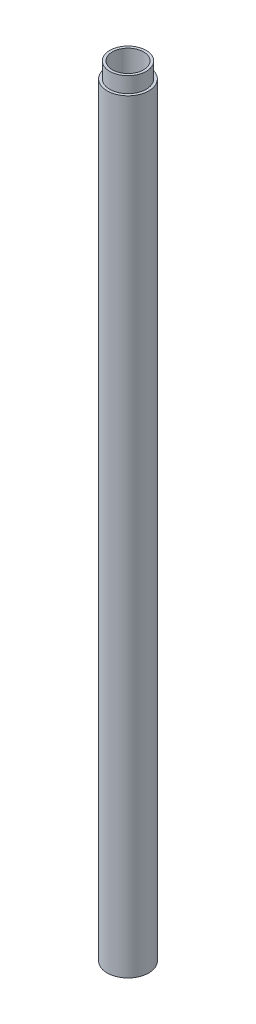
from build123d import *

# Parameters (mm, degrees)
SKICA1_R                 = 4
P_IDAT_VYSUNUT_M1_DEPTH  = 150
SKICA2_R                 = 3
ODEBRAT_VYSUNUT_M1_DEPTH = 151.106628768
SKICA3_OUTSIDE_W         = 40.086
SKICA3_OUTSIDE_H         = 40.086
SKICA3_OUTSIDE_R         = 3.5
ODEBRAT_VYSUNUT_M2_DEPTH = 3


with BuildPart() as part:
    # Skica1 → P_idat vysunut_m1 (new body)
    with BuildSketch(Plane(origin=(0, 0, 0), x_dir=(1, 0, 0), z_dir=(0, 1, 0))):
        with Locations(Location((0, 0, 0), (0, 0, 270))):
            Circle(SKICA1_R)
    extrude(amount=P_IDAT_VYSUNUT_M1_DEPTH)

    # Skica2 → Odebrat vysunut_m1 (cut, through all)
    with BuildSketch(Plane(origin=(0, 150, 0), x_dir=(1, 0, 0), z_dir=(0, 1, 0))):
        with Locations(Location((0, 0, 0), (0, 0, 270))):
            Circle(SKICA2_R)
    extrude(amount=-ODEBRAT_VYSUNUT_M1_DEPTH, mode=Mode.SUBTRACT)

    # Skica3 outside → Odebrat vysunut_m2 (cut)
    with BuildSketch(Plane(origin=(0, 150, 0), x_dir=(-1, 0, 0), z_dir=(0, 1, 0))):
        Rectangle(SKICA3_OUTSIDE_W, SKICA3_OUTSIDE_H)
        with Locations(Location((0, 0, 0), (0, 0, 90))):
            Circle(SKICA3_OUTSIDE_R, mode=Mode.SUBTRACT)
    extrude(amount=-ODEBRAT_VYSUNUT_M2_DEPTH, mode=Mode.SUBTRACT)


solid = part.part
